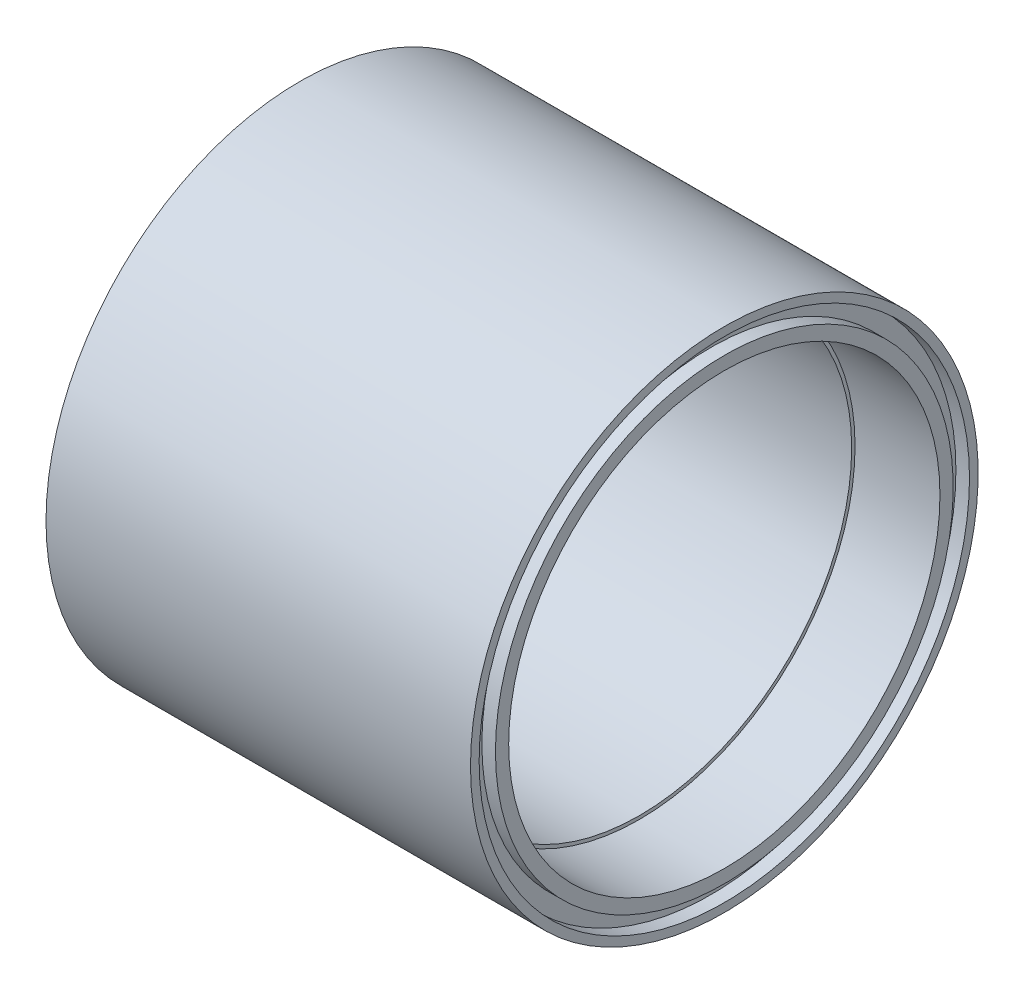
from build123d import *

# Parameters (mm, degrees)
SKETCH2_R          = 36.6776
SKETCH2_R_2        = 34.2392
CUT_EXTRUDE1_DEPTH = 2.032


with BuildPart() as part:
    # Sketch1 → Revolve1 (revolve)
    with BuildSketch(Plane.XY, mode=Mode.PRIVATE) as revolve1_sk:
        Polygon((-31.75, 37.973), (-31.75, 32.258), (-19.05, 32.258), (-19.05, 31.75), (19.05, 31.75), (19.05, 32.258), (31.75, 32.258), (31.75, 37.973), align=None)
    revolve(revolve1_sk.sketch.rotate(Axis((0, 0, 0), (1, 0, 0)), 90), axis=Axis((0, 0, 0), (1, 0, 0)))

    # Sketch2 → Cut-Extrude1 (cut)
    with BuildSketch(Plane.ZY.offset(31.75)):
        Circle(SKETCH2_R)
        Circle(SKETCH2_R_2, mode=Mode.SUBTRACT)
    cut_extrude1 = extrude(amount=-CUT_EXTRUDE1_DEPTH, mode=Mode.SUBTRACT)

    # Mirror1: Cut-Extrude1 across plane
    add(cut_extrude1.mirror(Plane(origin=(0, 0, 0), x_dir=(0, 0, 1), z_dir=(1, 0, 0))), mode=Mode.SUBTRACT)


solid = part.part
